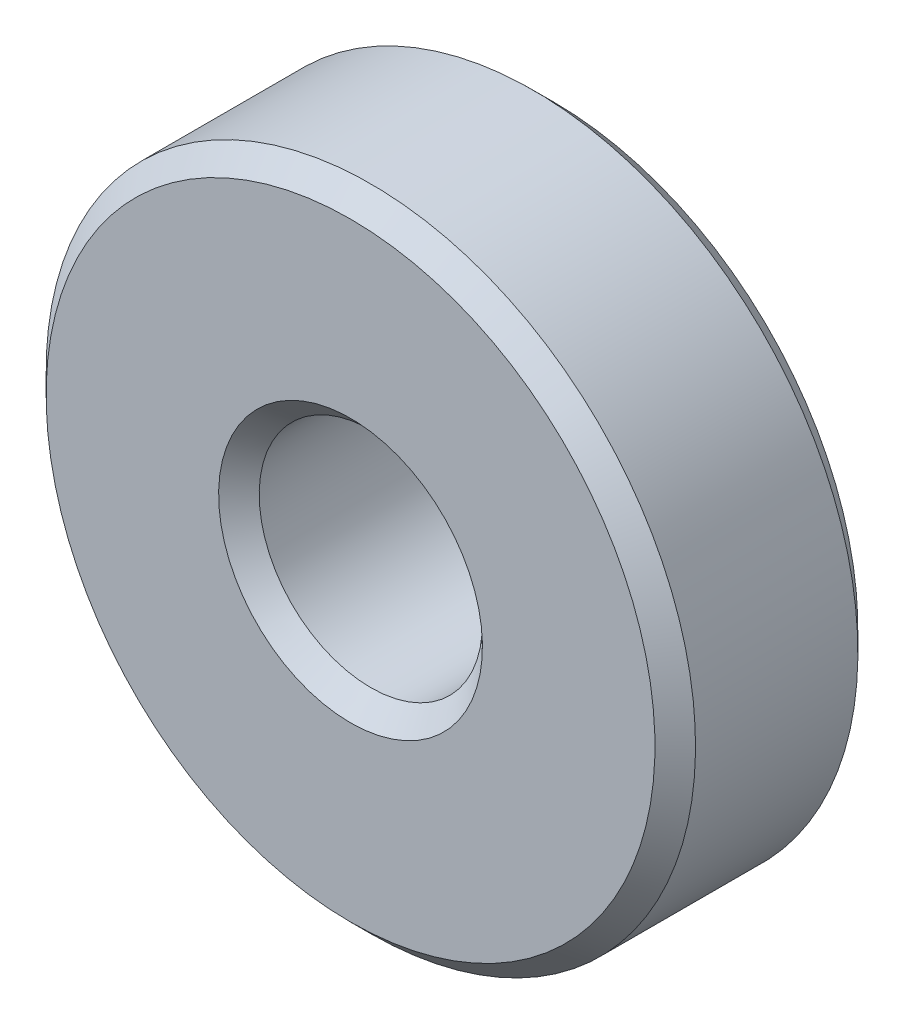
ISO-10303-21;
HEADER;
FILE_DESCRIPTION(('STEP AP214'),'2;1');
FILE_NAME('part.step','',(''),(''),'','','');
FILE_SCHEMA(('AUTOMOTIVE_DESIGN { 1 0 10303 214 1 1 1 1 }'));
ENDSEC;
DATA;
#1=APPLICATION_CONTEXT('core data for automotive mechanical design processes');
#2=APPLICATION_PROTOCOL_DEFINITION('international standard','automotive_design',2000,#1);
#3=PRODUCT_CONTEXT('',#1,'mechanical');
#4=PRODUCT('Part','Part','',(#3));
#5=PRODUCT_RELATED_PRODUCT_CATEGORY('part','',(#4));
#6=PRODUCT_DEFINITION_FORMATION('','',#4);
#7=PRODUCT_DEFINITION_CONTEXT('part definition',#1,'design');
#8=PRODUCT_DEFINITION('design','',#6,#7);
#9=PRODUCT_DEFINITION_SHAPE('','',#8);
#10=(LENGTH_UNIT() NAMED_UNIT(*) SI_UNIT(.MILLI.,.METRE.));
#11=(NAMED_UNIT(*) PLANE_ANGLE_UNIT() SI_UNIT($,.RADIAN.));
#12=(NAMED_UNIT(*) SI_UNIT($,.STERADIAN.) SOLID_ANGLE_UNIT());
#13=UNCERTAINTY_MEASURE_WITH_UNIT(LENGTH_MEASURE(1.E-05),#10,'distance_accuracy_value','');
#14=(GEOMETRIC_REPRESENTATION_CONTEXT(3) GLOBAL_UNCERTAINTY_ASSIGNED_CONTEXT((#13)) GLOBAL_UNIT_ASSIGNED_CONTEXT((#10,
#11,#12)) REPRESENTATION_CONTEXT('',''));
#15=CARTESIAN_POINT('',(0.,0.,0.));
#16=DIRECTION('',(0.,0.,1.));
#17=DIRECTION('',(1.,0.,0.));
#18=AXIS2_PLACEMENT_3D('',#15,#16,#17);
#19=CARTESIAN_POINT('',(0.,0.,0.499999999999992));
#20=DIRECTION('',(0.,0.,-1.));
#21=DIRECTION('',(0.,1.,0.));
#22=AXIS2_PLACEMENT_3D('',#19,#20,#21);
#23=CONICAL_SURFACE('',#22,2.75,0.785398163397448);
#24=CARTESIAN_POINT('',(0.,0.,0.));
#25=DIRECTION('',(0.,0.,1.));
#26=DIRECTION('',(0.,-1.,0.));
#27=AXIS2_PLACEMENT_3D('',#24,#25,#26);
#28=CIRCLE('',#27,3.25);
#29=CARTESIAN_POINT('',(0.,-3.25,0.));
#30=VERTEX_POINT('',#29);
#31=EDGE_CURVE('E10',#30,#30,#28,.T.);
#32=ORIENTED_EDGE('',*,*,#31,.F.);
#33=EDGE_LOOP('',(#32));
#34=FACE_BOUND('',#33,.T.);
#35=CARTESIAN_POINT('',(0.,0.,0.499999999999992));
#36=DIRECTION('',(0.,0.,1.));
#37=DIRECTION('',(0.,-1.,0.));
#38=AXIS2_PLACEMENT_3D('',#35,#36,#37);
#39=CIRCLE('',#38,2.75);
#40=CARTESIAN_POINT('',(0.,-2.75,0.499999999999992));
#41=VERTEX_POINT('',#40);
#42=EDGE_CURVE('E60',#41,#41,#39,.T.);
#43=ORIENTED_EDGE('',*,*,#42,.T.);
#44=EDGE_LOOP('',(#43));
#45=FACE_BOUND('',#44,.T.);
#46=ADVANCED_FACE('F32',(#34,#45),#23,.F.);
#47=CARTESIAN_POINT('',(0.,3.25,0.));
#48=DIRECTION('',(0.,0.,1.));
#49=DIRECTION('',(0.,-1.,0.));
#50=AXIS2_PLACEMENT_3D('',#47,#48,#49);
#51=PLANE('',#50);
#52=CARTESIAN_POINT('',(0.,0.,0.));
#53=DIRECTION('',(0.,0.,1.));
#54=DIRECTION('',(0.,-1.,0.));
#55=AXIS2_PLACEMENT_3D('',#52,#53,#54);
#56=CIRCLE('',#55,7.5);
#57=CARTESIAN_POINT('',(0.,-7.5,0.));
#58=VERTEX_POINT('',#57);
#59=EDGE_CURVE('E38',#58,#58,#56,.T.);
#60=ORIENTED_EDGE('',*,*,#59,.F.);
#61=EDGE_LOOP('',(#60));
#62=FACE_BOUND('',#61,.T.);
#63=ORIENTED_EDGE('',*,*,#31,.T.);
#64=EDGE_LOOP('',(#63));
#65=FACE_BOUND('',#64,.T.);
#66=ADVANCED_FACE('F97',(#62,#65),#51,.F.);
#67=CARTESIAN_POINT('',(0.,0.,0.));
#68=DIRECTION('',(0.,0.,1.));
#69=DIRECTION('',(0.,-1.,0.));
#70=AXIS2_PLACEMENT_3D('',#67,#68,#69);
#71=CONICAL_SURFACE('',#70,7.5,0.785398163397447);
#72=CARTESIAN_POINT('',(0.,0.,0.499999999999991));
#73=DIRECTION('',(0.,0.,1.));
#74=DIRECTION('',(0.,-1.,0.));
#75=AXIS2_PLACEMENT_3D('',#72,#73,#74);
#76=CIRCLE('',#75,8.);
#77=CARTESIAN_POINT('',(0.,-8.,0.499999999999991));
#78=VERTEX_POINT('',#77);
#79=EDGE_CURVE('E42',#78,#78,#76,.T.);
#80=ORIENTED_EDGE('',*,*,#79,.F.);
#81=EDGE_LOOP('',(#80));
#82=FACE_BOUND('',#81,.T.);
#83=ORIENTED_EDGE('',*,*,#59,.T.);
#84=EDGE_LOOP('',(#83));
#85=FACE_BOUND('',#84,.T.);
#86=ADVANCED_FACE('F92',(#82,#85),#71,.T.);
#87=CARTESIAN_POINT('',(0.,0.,4.99999999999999));
#88=DIRECTION('',(0.,0.,1.));
#89=DIRECTION('',(0.,-1.,0.));
#90=AXIS2_PLACEMENT_3D('',#87,#88,#89);
#91=CYLINDRICAL_SURFACE('',#90,8.);
#92=CARTESIAN_POINT('',(0.,0.,4.5));
#93=DIRECTION('',(0.,0.,1.));
#94=DIRECTION('',(0.,-1.,0.));
#95=AXIS2_PLACEMENT_3D('',#92,#93,#94);
#96=CIRCLE('',#95,8.);
#97=CARTESIAN_POINT('',(0.,-8.,4.5));
#98=VERTEX_POINT('',#97);
#99=EDGE_CURVE('E46',#98,#98,#96,.T.);
#100=ORIENTED_EDGE('',*,*,#99,.F.);
#101=EDGE_LOOP('',(#100));
#102=FACE_BOUND('',#101,.T.);
#103=ORIENTED_EDGE('',*,*,#79,.T.);
#104=EDGE_LOOP('',(#103));
#105=FACE_BOUND('',#104,.T.);
#106=ADVANCED_FACE('F86',(#102,#105),#91,.T.);
#107=CARTESIAN_POINT('',(0.,0.,4.5));
#108=DIRECTION('',(0.,0.,-1.));
#109=DIRECTION('',(0.,1.,0.));
#110=AXIS2_PLACEMENT_3D('',#107,#108,#109);
#111=CONICAL_SURFACE('',#110,8.,0.785398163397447);
#112=CARTESIAN_POINT('',(0.,0.,4.99999999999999));
#113=DIRECTION('',(0.,0.,1.));
#114=DIRECTION('',(0.,-1.,0.));
#115=AXIS2_PLACEMENT_3D('',#112,#113,#114);
#116=CIRCLE('',#115,7.50000000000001);
#117=CARTESIAN_POINT('',(0.,-7.50000000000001,4.99999999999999));
#118=VERTEX_POINT('',#117);
#119=EDGE_CURVE('E51',#118,#118,#116,.T.);
#120=ORIENTED_EDGE('',*,*,#119,.F.);
#121=EDGE_LOOP('',(#120));
#122=FACE_BOUND('',#121,.T.);
#123=ORIENTED_EDGE('',*,*,#99,.T.);
#124=EDGE_LOOP('',(#123));
#125=FACE_BOUND('',#124,.T.);
#126=ADVANCED_FACE('F80',(#122,#125),#111,.T.);
#127=CARTESIAN_POINT('',(0.,7.50000000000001,4.99999999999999));
#128=DIRECTION('',(0.,0.,-1.));
#129=DIRECTION('',(0.,1.,0.));
#130=AXIS2_PLACEMENT_3D('',#127,#128,#129);
#131=PLANE('',#130);
#132=CARTESIAN_POINT('',(0.,0.,4.99999999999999));
#133=DIRECTION('',(0.,0.,1.));
#134=DIRECTION('',(0.,-1.,0.));
#135=AXIS2_PLACEMENT_3D('',#132,#133,#134);
#136=CIRCLE('',#135,3.25000000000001);
#137=CARTESIAN_POINT('',(0.,-3.25000000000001,4.99999999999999));
#138=VERTEX_POINT('',#137);
#139=EDGE_CURVE('E54',#138,#138,#136,.T.);
#140=ORIENTED_EDGE('',*,*,#139,.F.);
#141=EDGE_LOOP('',(#140));
#142=FACE_BOUND('',#141,.T.);
#143=ORIENTED_EDGE('',*,*,#119,.T.);
#144=EDGE_LOOP('',(#143));
#145=FACE_BOUND('',#144,.T.);
#146=ADVANCED_FACE('F74',(#142,#145),#131,.F.);
#147=CARTESIAN_POINT('',(0.,0.,4.99999999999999));
#148=DIRECTION('',(0.,0.,1.));
#149=DIRECTION('',(0.,-1.,0.));
#150=AXIS2_PLACEMENT_3D('',#147,#148,#149);
#151=CONICAL_SURFACE('',#150,3.25000000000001,0.785398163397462);
#152=CARTESIAN_POINT('',(0.,0.,4.5));
#153=DIRECTION('',(0.,0.,1.));
#154=DIRECTION('',(0.,-1.,0.));
#155=AXIS2_PLACEMENT_3D('',#152,#153,#154);
#156=CIRCLE('',#155,2.75);
#157=CARTESIAN_POINT('',(0.,-2.75,4.5));
#158=VERTEX_POINT('',#157);
#159=EDGE_CURVE('E57',#158,#158,#156,.T.);
#160=ORIENTED_EDGE('',*,*,#159,.F.);
#161=EDGE_LOOP('',(#160));
#162=FACE_BOUND('',#161,.T.);
#163=ORIENTED_EDGE('',*,*,#139,.T.);
#164=EDGE_LOOP('',(#163));
#165=FACE_BOUND('',#164,.T.);
#166=ADVANCED_FACE('F68',(#162,#165),#151,.F.);
#167=CARTESIAN_POINT('',(0.,0.,4.99999999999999));
#168=DIRECTION('',(0.,0.,1.));
#169=DIRECTION('',(0.,-1.,0.));
#170=AXIS2_PLACEMENT_3D('',#167,#168,#169);
#171=CYLINDRICAL_SURFACE('',#170,2.75);
#172=ORIENTED_EDGE('',*,*,#42,.F.);
#173=EDGE_LOOP('',(#172));
#174=FACE_BOUND('',#173,.T.);
#175=ORIENTED_EDGE('',*,*,#159,.T.);
#176=EDGE_LOOP('',(#175));
#177=FACE_BOUND('',#176,.T.);
#178=ADVANCED_FACE('F65',(#174,#177),#171,.F.);
#179=CLOSED_SHELL('',(#46,#66,#86,#106,#126,#146,#166,#178));
#180=MANIFOLD_SOLID_BREP('B2',#179);
#181=ADVANCED_BREP_SHAPE_REPRESENTATION('',(#18,#180),#14);
#182=SHAPE_DEFINITION_REPRESENTATION(#9,#181);
ENDSEC;
END-ISO-10303-21;
